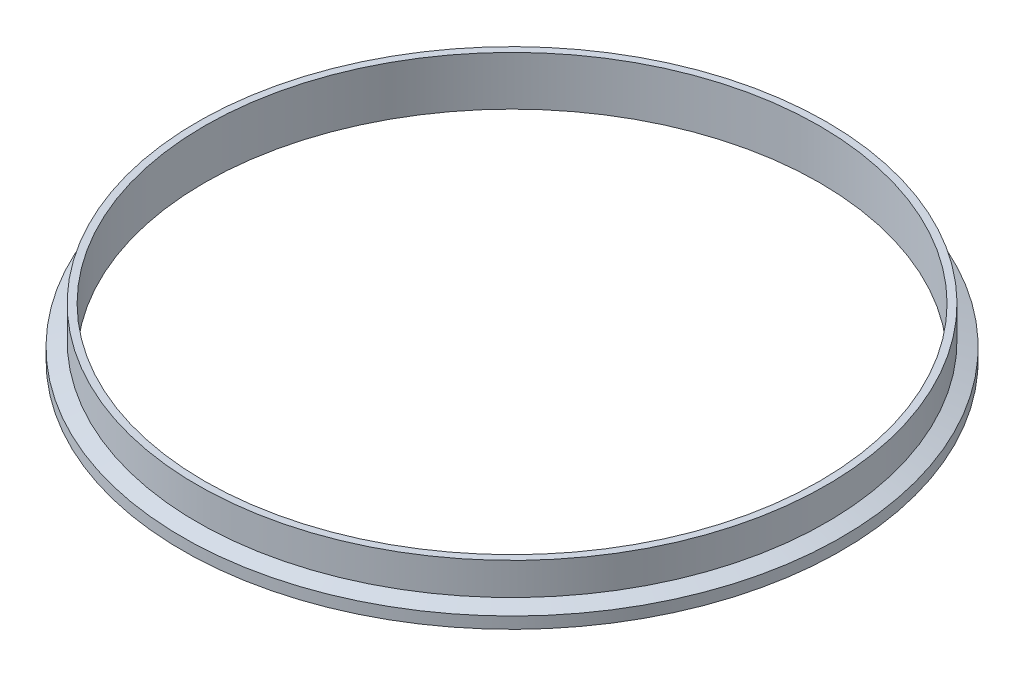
from build123d import *


with BuildPart() as part:
    # Sketch1 → Revolve2 (revolve)
    with BuildSketch(Plane.XY, mode=Mode.PRIVATE) as revolve2_sk:
        with BuildLine():
            Line((-148.9964, 0), (-148.9964, 23.8125))
            Line((-148.9964, 23.8125), (-152.4, 23.8125))
            Line((-152.4, 23.8125), (-152.4, 8.222780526))
            Line((-152.4, 8.222780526), (-159.639, 5.588))
            Line((-159.639, 5.588), (-159.639, 0))
            Line((-159.639, 0), (-156.199208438, 0))
            ThreePointArc((-156.199208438, 0), (-155.767011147, 0.129217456), (-155.476666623, 0.474458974))
            ThreePointArc((-155.476666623, 0.474458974), (-154.3812, 1.1938), (-153.285733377, 0.474458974))
            ThreePointArc((-153.285733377, 0.474458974), (-152.995388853, 0.129217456), (-152.563191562, 0))
            Line((-152.563191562, 0), (-148.9964, 0))
        make_face()
    revolve(revolve2_sk.sketch.rotate(Axis((0, 0, 0), (0, 1, 0)), 270), axis=Axis((0, 0, 0), (0, 1, 0)))


solid = part.part
